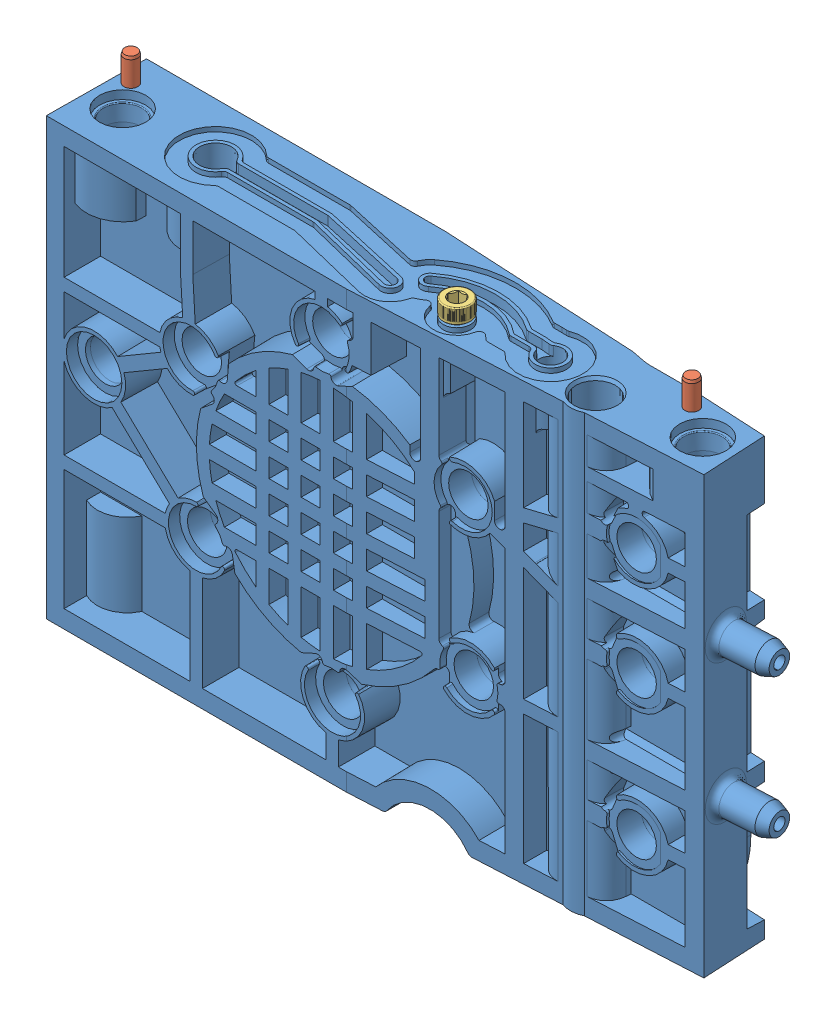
SolidWorks assembly 020100_AR_cartridge_bottom.SLDASM, configuration Default (file format 15000). Lengths in mm.
Overall size (236.56 99.65 14.01).
17 component instances, 4 part files, 10 mates.
Components (placement in the parent):
- 020101_AR_cartridge_bottom_inserts-1: 020101_AR_cartridge_bottom_inserts.SLDASM [Default] at origin size (236.56 99.65 14.01)
  - 020101-1_AR_cartridge_bottom-1: 020101-1_AR_cartridge_bottom.SLDPRT [0.5] at origin size (236.56 99.65 14.01)
  - 019901_insert_M2.5-1: 019901_insert_M2.5.SLDPRT [Default] at (29.9154 -58.2602 4.2) x (0 0 1) z (-0.923728 -0.383049 0) size (3.5 4.5 4.5)
  - 019901_insert_M2.5-2: 019901_insert_M2.5.SLDPRT [Default] at (45.2894 -82.8636 4.2) x (0 0 1) z (-0.85131 -0.524663 0) size (3.5 4.5 4.5)
  - 019901_insert_M2.5-3: 019901_insert_M2.5.SLDPRT [Default] at (15.7106 -67.1364 4.2) x (0 0 1) z (-0.777574 -0.628792 0) size (3.5 4.5 4.5)
  - 019901_insert_M2.5-4: 019901_insert_M2.5.SLDPRT [Default] at (16.2952 -83.8761 4.2) x (0 0 1) z (-0.715577 -0.698533 0) size (3.5 4.5 4.5)
  - 019901_insert_M2.5-7: 019901_insert_M2.5.SLDPRT [Default] at (31.0846 -91.7398 4.2) x (0 0 1) z (-0.699005 -0.715117 0) size (3.5 4.5 4.5)
  - 019901_insert_M2.5-14: 019901_insert_M2.5.SLDPRT [Default] at (62.5 -74.3 3.7) x (0 0 1) z (-0.516226 0.856452 0) size (3.5 4.5 4.5)
  - 019901_insert_M2.5-19: 019901_insert_M2.5.SLDPRT [Default] at (44.7048 -66.1239 4.2) x (0 0 1) z (-0.797228 0.603678 0) size (3.5 4.5 4.5)
  - 019901_insert_M2.5-22: 019901_insert_M2.5.SLDPRT [Default] at (62.5 -89.5 3.7) x (0 0 1) z (-0.898458 0.439059 0) size (3.5 4.5 4.5)
  - 019901_insert_M2.5-23: 019901_insert_M2.5.SLDPRT [Default] at (62.5 -62.5 3.7) x (0 0 1) z (-0.645489 0.763769 0) size (3.5 4.5 4.5)
  - 019901_insert_M2.5-25: 019901_insert_M2.5.SLDPRT [Default] at (5.2 -73.3 4.2) x (0 0 1) z (-0.737487 0.675361 0) size (3.5 4.5 4.5)
- 019905_pin_m1p5x8_91585A133-2: 019905_pin_m1p5x8_91585A133.SLDPRT [91585A133] at (62.5 -53.2131 -2.3) x (0 -1 0) z (-0.280952 0 0.959722) size (8 1.5 1.5)
- 019905_pin_m1p5x8_91585A133-1: 019905_pin_m1p5x8_91585A133.SLDPRT [91585A133] at (1.5 -53.2131 -2.3) x (0 -1 0) z (-0.456782 0 0.889579) size (8 1.5 1.5)
- 019901_insert_M2.5-11: 019901_insert_M2.5.SLDPRT [Default] at (3.5 -53.1 0.6) x (0 1 0) z (-0.718844 0 0.695171) size (3.5 4.5 4.5)
- 019901_insert_M2.5-13: 019901_insert_M2.5.SLDPRT [Default] at (66 -53.1 0) x (0 1 0) z (-0.389051 0 0.921216) size (3.5 4.5 4.5)
- 019914_scr_seal_m1p6x4-1: 019914_scr_seal_m1p6x4.SLDPRT [Default] at (41.25 -53.1625 2) x (-0.791029 0 0.611779) z (0 1 0) size (3 3 5.6)
Mates (geometry in assembly coordinates):
- Concentric9: concentric aligned: cylinder of 019901_insert_IUC-M2.5-1-11 through (3.5 -162.1615 0.6) axis (0 -1 0) radius 2.25; cone of 020101_AR_cartridge_bottom_inserts-1/020101-1_AR_cartridge_bottom-1 through (3.5 -53.1 0.6) axis (0 -1 0)
- Coincident10: coincident aligned: plane of 020101_AR_cartridge_bottom_inserts-1/020101-1_AR_cartridge_bottom-1 through (5.6 -53.1 0.6) normal (0 1 0); plane of 019901_insert_IUC-M2.5-1-11 through (5.0641 -53.1 2.2174) normal (0 1 0)
- Concentric10: concentric aligned: cylinder of 019901_insert_IUC-M2.5-1-13 through (66 -162.1615 0) axis (0 -1 0) radius 2.25; cone of 020101_AR_cartridge_bottom_inserts-1/020101-1_AR_cartridge_bottom-1 through (66 -53.1 0) axis (0 -1 0)
- Coincident11: coincident aligned: plane of 020101_AR_cartridge_bottom_inserts-1/020101-1_AR_cartridge_bottom-1 through (68.1 -53.1 0) normal (0 1 0); plane of 019901_insert_IUC-M2.5-1-13 through (68.0727 -53.1 0.8754) normal (0 1 0)
- Concentric164: concentric anti-aligned: cylinder of 019914_scr_seal_m1p6x4-1 through (41.25 -50.3625 2) axis (0 1 0) radius 0.8; cone of 020101_AR_cartridge_bottom_inserts-1/020101-1_AR_cartridge_bottom-1 through (41.25 -57.1 2) axis (0 -1 0)
- Tangent13: tangent anti-aligned: plane of 020101_AR_cartridge_bottom_inserts-1/020101-1_AR_cartridge_bottom-1 through (0 -52.2 0) normal (0 1 0); torus of 019914_scr_seal_m1p6x4-1
- Coincident27: coincident anti-aligned: circle of 020101_AR_cartridge_bottom_inserts-1/020101-1_AR_cartridge_bottom-1; plane of 019905_pin_m1p5x8_91585A133-1 through (1.5 -57.2131 -2.3) normal (0 -1 0)
- Concentric162: concentric aligned: cylinder of 019905_pin_m1p5x8_91585A133-1 through (1.5 -49.5131 -2.3) axis (0 -1 0) radius 0.75; cone of 020101_AR_cartridge_bottom_inserts-1/020101-1_AR_cartridge_bottom-1 through (1.5 -52.2 -2.3) axis (0 -1 0)
- Concentric163: concentric aligned: cylinder of 019905_pin_m1p5x8_91585A133-2 through (62.5 -49.5131 -2.3) axis (0 -1 0) radius 0.75; cone of 020101_AR_cartridge_bottom_inserts-1/020101-1_AR_cartridge_bottom-1 through (62.5 -52.2 -2.3) axis (0 -1 0)
- Coincident28: coincident anti-aligned: circle of 020101_AR_cartridge_bottom_inserts-1/020101-1_AR_cartridge_bottom-1; plane of 019905_pin_m1p5x8_91585A133-2 through (62.5 -57.2131 -2.3) normal (0 -1 0)
